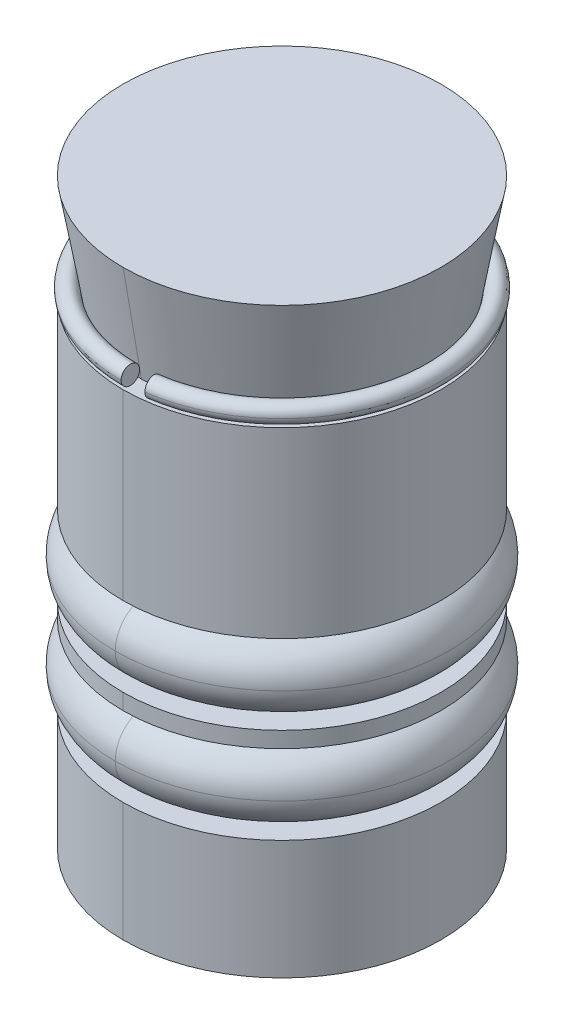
ISO-10303-21;
HEADER;
FILE_DESCRIPTION(('STEP AP214'),'2;1');
FILE_NAME('part.step','',(''),(''),'','','');
FILE_SCHEMA(('AUTOMOTIVE_DESIGN { 1 0 10303 214 1 1 1 1 }'));
ENDSEC;
DATA;
#1=APPLICATION_CONTEXT('core data for automotive mechanical design processes');
#2=APPLICATION_PROTOCOL_DEFINITION('international standard','automotive_design',2000,#1);
#3=PRODUCT_CONTEXT('',#1,'mechanical');
#4=PRODUCT('Part','Part','',(#3));
#5=PRODUCT_RELATED_PRODUCT_CATEGORY('part','',(#4));
#6=PRODUCT_DEFINITION_FORMATION('','',#4);
#7=PRODUCT_DEFINITION_CONTEXT('part definition',#1,'design');
#8=PRODUCT_DEFINITION('design','',#6,#7);
#9=PRODUCT_DEFINITION_SHAPE('','',#8);
#10=(LENGTH_UNIT() NAMED_UNIT(*) SI_UNIT(.MILLI.,.METRE.));
#11=(NAMED_UNIT(*) PLANE_ANGLE_UNIT() SI_UNIT($,.RADIAN.));
#12=(NAMED_UNIT(*) SI_UNIT($,.STERADIAN.) SOLID_ANGLE_UNIT());
#13=UNCERTAINTY_MEASURE_WITH_UNIT(LENGTH_MEASURE(1.E-05),#10,'distance_accuracy_value','');
#14=(GEOMETRIC_REPRESENTATION_CONTEXT(3) GLOBAL_UNCERTAINTY_ASSIGNED_CONTEXT((#13)) GLOBAL_UNIT_ASSIGNED_CONTEXT((#10,
#11,#12)) REPRESENTATION_CONTEXT('',''));
#15=CARTESIAN_POINT('',(0.,0.,0.));
#16=DIRECTION('',(0.,0.,1.));
#17=DIRECTION('',(1.,0.,0.));
#18=AXIS2_PLACEMENT_3D('',#15,#16,#17);
#19=CARTESIAN_POINT('',(0.396863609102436,9.175,2.83655403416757));
#20=DIRECTION('',(0.990353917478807,0.,-0.138560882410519));
#21=DIRECTION('',(0.,-1.,0.));
#22=AXIS2_PLACEMENT_3D('',#19,#20,#21);
#23=PLANE('',#22);
#24=CARTESIAN_POINT('',(0.396863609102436,9.175,2.83655403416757));
#25=DIRECTION('',(0.990353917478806,0.,-0.138560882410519));
#26=DIRECTION('',(-0.138560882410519,0.,-0.990353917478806));
#27=AXIS2_PLACEMENT_3D('',#24,#25,#26);
#28=CIRCLE('',#27,0.175);
#29=CARTESIAN_POINT('',(0.372615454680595,9.175,2.66324209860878));
#30=VERTEX_POINT('',#29);
#31=CARTESIAN_POINT('',(0.421111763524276,9.175,3.00986596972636));
#32=VERTEX_POINT('',#31);
#33=EDGE_CURVE('P0_E56',#30,#32,#28,.T.);
#34=ORIENTED_EDGE('',*,*,#33,.F.);
#35=CARTESIAN_POINT('',(0.396863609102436,9.175,2.83655403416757));
#36=DIRECTION('',(0.990353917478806,0.,-0.138560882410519));
#37=DIRECTION('',(-0.138560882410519,0.,-0.990353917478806));
#38=AXIS2_PLACEMENT_3D('',#35,#36,#37);
#39=CIRCLE('',#38,0.175);
#40=EDGE_CURVE('P0_E26',#32,#30,#39,.T.);
#41=ORIENTED_EDGE('',*,*,#40,.F.);
#42=EDGE_LOOP('',(#34,#41));
#43=FACE_BOUND('',#42,.T.);
#44=ADVANCED_FACE('P0_F16',(#43),#23,.F.);
#45=CARTESIAN_POINT('',(0.,9.175,2.86418217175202));
#46=DIRECTION('',(1.,0.,0.));
#47=DIRECTION('',(0.,1.,0.));
#48=AXIS2_PLACEMENT_3D('',#45,#46,#47);
#49=PLANE('',#48);
#50=CARTESIAN_POINT('',(0.,9.175,2.86418217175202));
#51=DIRECTION('',(1.,0.,0.));
#52=DIRECTION('',(0.,0.,-1.));
#53=AXIS2_PLACEMENT_3D('',#50,#51,#52);
#54=CIRCLE('',#53,0.175);
#55=CARTESIAN_POINT('',(0.,9.175,2.68918217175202));
#56=VERTEX_POINT('',#55);
#57=CARTESIAN_POINT('',(0.,9.175,3.03918217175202));
#58=VERTEX_POINT('',#57);
#59=EDGE_CURVE('P0_E19',#56,#58,#54,.T.);
#60=ORIENTED_EDGE('',*,*,#59,.T.);
#61=CARTESIAN_POINT('',(0.,9.175,2.86418217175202));
#62=DIRECTION('',(1.,0.,0.));
#63=DIRECTION('',(0.,0.,-1.));
#64=AXIS2_PLACEMENT_3D('',#61,#62,#63);
#65=CIRCLE('',#64,0.175);
#66=EDGE_CURVE('P0_E11',#58,#56,#65,.T.);
#67=ORIENTED_EDGE('',*,*,#66,.T.);
#68=EDGE_LOOP('',(#60,#67));
#69=FACE_BOUND('',#68,.T.);
#70=ADVANCED_FACE('P0_F79',(#69),#49,.T.);
#71=CARTESIAN_POINT('',(0.,9.175,0.));
#72=DIRECTION('',(0.,1.,0.));
#73=DIRECTION('',(0.,0.,1.));
#74=AXIS2_PLACEMENT_3D('',#71,#72,#73);
#75=TOROIDAL_SURFACE('',#74,2.86418217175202,0.175);
#76=CARTESIAN_POINT('',(0.,9.175,0.));
#77=DIRECTION('',(0.,1.,0.));
#78=DIRECTION('',(0.,0.,1.));
#79=AXIS2_PLACEMENT_3D('',#76,#77,#78);
#80=CIRCLE('',#79,3.03918217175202);
#81=EDGE_CURVE('P0_E61',#32,#58,#80,.T.);
#82=ORIENTED_EDGE('',*,*,#81,.F.);
#83=ORIENTED_EDGE('',*,*,#40,.T.);
#84=CARTESIAN_POINT('',(0.,9.175,0.));
#85=DIRECTION('',(0.,1.,0.));
#86=DIRECTION('',(0.,0.,1.));
#87=AXIS2_PLACEMENT_3D('',#84,#85,#86);
#88=CIRCLE('',#87,2.68918217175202);
#89=EDGE_CURVE('P0_E58',#30,#56,#88,.T.);
#90=ORIENTED_EDGE('',*,*,#89,.T.);
#91=ORIENTED_EDGE('',*,*,#66,.F.);
#92=EDGE_LOOP('',(#82,#83,#90,#91));
#93=FACE_BOUND('',#92,.T.);
#94=ADVANCED_FACE('P0_F62',(#93),#75,.T.);
#95=CARTESIAN_POINT('',(0.,9.175,0.));
#96=DIRECTION('',(0.,1.,0.));
#97=DIRECTION('',(0.,0.,1.));
#98=AXIS2_PLACEMENT_3D('',#95,#96,#97);
#99=TOROIDAL_SURFACE('',#98,2.86418217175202,0.175);
#100=ORIENTED_EDGE('',*,*,#33,.T.);
#101=ORIENTED_EDGE('',*,*,#81,.T.);
#102=ORIENTED_EDGE('',*,*,#59,.F.);
#103=ORIENTED_EDGE('',*,*,#89,.F.);
#104=EDGE_LOOP('',(#100,#101,#102,#103));
#105=FACE_BOUND('',#104,.T.);
#106=ADVANCED_FACE('P0_F67',(#105),#99,.T.);
#107=CLOSED_SHELL('',(#44,#70,#94,#106));
#108=MANIFOLD_SOLID_BREP('P0_B1',#107);
#109=CARTESIAN_POINT('',(0.,11.,0.));
#110=DIRECTION('',(0.,-1.,0.));
#111=DIRECTION('',(0.,0.,-1.));
#112=AXIS2_PLACEMENT_3D('',#109,#110,#111);
#113=PLANE('',#112);
#114=CARTESIAN_POINT('',(0.,11.,0.));
#115=DIRECTION('',(0.,1.,0.));
#116=DIRECTION('',(0.,0.,1.));
#117=AXIS2_PLACEMENT_3D('',#114,#115,#116);
#118=CIRCLE('',#117,3.);
#119=CARTESIAN_POINT('',(0.,11.,3.));
#120=VERTEX_POINT('',#119);
#121=CARTESIAN_POINT('',(0.,11.,-3.));
#122=VERTEX_POINT('',#121);
#123=EDGE_CURVE('P1_E173',#120,#122,#118,.T.);
#124=ORIENTED_EDGE('',*,*,#123,.T.);
#125=CARTESIAN_POINT('',(0.,11.,0.));
#126=DIRECTION('',(0.,1.,0.));
#127=DIRECTION('',(0.,0.,1.));
#128=AXIS2_PLACEMENT_3D('',#125,#126,#127);
#129=CIRCLE('',#128,3.);
#130=EDGE_CURVE('P1_E11',#122,#120,#129,.T.);
#131=ORIENTED_EDGE('',*,*,#130,.T.);
#132=EDGE_LOOP('',(#124,#131));
#133=FACE_BOUND('',#132,.T.);
#134=ADVANCED_FACE('P1_F16',(#133),#113,.F.);
#135=CARTESIAN_POINT('',(0.,9.,0.));
#136=DIRECTION('',(0.,1.,0.));
#137=DIRECTION('',(0.,0.,1.));
#138=AXIS2_PLACEMENT_3D('',#135,#136,#137);
#139=CONICAL_SURFACE('',#138,2.65371595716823,0.171442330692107);
#140=DIRECTION('',(0.,0.985339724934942,-0.170603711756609));
#141=VECTOR('',#140,1.);
#142=CARTESIAN_POINT('',(0.,9.,-2.65371595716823));
#143=LINE('',#142,#141);
#144=CARTESIAN_POINT('',(0.,9.,-2.65371595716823));
#145=VERTEX_POINT('',#144);
#146=EDGE_CURVE('P1_E162',#145,#122,#143,.T.);
#147=ORIENTED_EDGE('',*,*,#146,.F.);
#148=CARTESIAN_POINT('',(0.,9.,0.));
#149=DIRECTION('',(0.,1.,0.));
#150=DIRECTION('',(0.,0.,1.));
#151=AXIS2_PLACEMENT_3D('',#148,#149,#150);
#152=CIRCLE('',#151,2.65371595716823);
#153=CARTESIAN_POINT('',(0.,9.,2.65371595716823));
#154=VERTEX_POINT('',#153);
#155=EDGE_CURVE('P1_E27',#145,#154,#152,.T.);
#156=ORIENTED_EDGE('',*,*,#155,.T.);
#157=DIRECTION('',(0.,0.985339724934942,0.170603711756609));
#158=VECTOR('',#157,1.);
#159=CARTESIAN_POINT('',(0.,9.,2.65371595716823));
#160=LINE('',#159,#158);
#161=EDGE_CURVE('P1_E159',#154,#120,#160,.T.);
#162=ORIENTED_EDGE('',*,*,#161,.T.);
#163=ORIENTED_EDGE('',*,*,#130,.F.);
#164=EDGE_LOOP('',(#147,#156,#162,#163));
#165=FACE_BOUND('',#164,.T.);
#166=ADVANCED_FACE('P1_F18',(#165),#139,.T.);
#167=CARTESIAN_POINT('',(0.,9.,-3.));
#168=DIRECTION('',(0.,-1.,0.));
#169=DIRECTION('',(0.,0.,-1.));
#170=AXIS2_PLACEMENT_3D('',#167,#168,#169);
#171=PLANE('',#170);
#172=CARTESIAN_POINT('',(0.,9.,0.));
#173=DIRECTION('',(0.,1.,0.));
#174=DIRECTION('',(0.,0.,1.));
#175=AXIS2_PLACEMENT_3D('',#172,#173,#174);
#176=CIRCLE('',#175,2.65371595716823);
#177=EDGE_CURVE('P1_E171',#154,#145,#176,.T.);
#178=ORIENTED_EDGE('',*,*,#177,.F.);
#179=ORIENTED_EDGE('',*,*,#155,.F.);
#180=EDGE_LOOP('',(#178,#179));
#181=FACE_BOUND('',#180,.T.);
#182=CARTESIAN_POINT('',(0.,9.,0.));
#183=DIRECTION('',(0.,1.,0.));
#184=DIRECTION('',(0.,0.,1.));
#185=AXIS2_PLACEMENT_3D('',#182,#183,#184);
#186=CIRCLE('',#185,3.);
#187=CARTESIAN_POINT('',(0.,9.,3.));
#188=VERTEX_POINT('',#187);
#189=CARTESIAN_POINT('',(0.,9.,-3.));
#190=VERTEX_POINT('',#189);
#191=EDGE_CURVE('P1_E235',#188,#190,#186,.T.);
#192=ORIENTED_EDGE('',*,*,#191,.T.);
#193=CARTESIAN_POINT('',(0.,9.,0.));
#194=DIRECTION('',(0.,1.,0.));
#195=DIRECTION('',(0.,0.,1.));
#196=AXIS2_PLACEMENT_3D('',#193,#194,#195);
#197=CIRCLE('',#196,3.);
#198=EDGE_CURVE('P1_E167',#190,#188,#197,.T.);
#199=ORIENTED_EDGE('',*,*,#198,.T.);
#200=EDGE_LOOP('',(#192,#199));
#201=FACE_BOUND('',#200,.T.);
#202=ADVANCED_FACE('P1_F177',(#181,#201),#171,.F.);
#203=CARTESIAN_POINT('',(0.,11.,0.));
#204=DIRECTION('',(0.,1.,0.));
#205=DIRECTION('',(0.,0.,1.));
#206=AXIS2_PLACEMENT_3D('',#203,#204,#205);
#207=CYLINDRICAL_SURFACE('',#206,3.);
#208=DIRECTION('',(0.,1.,0.));
#209=VECTOR('',#208,1.);
#210=CARTESIAN_POINT('',(0.,11.,-3.));
#211=LINE('',#210,#209);
#212=CARTESIAN_POINT('',(0.,5.55,-3.));
#213=VERTEX_POINT('',#212);
#214=EDGE_CURVE('P1_E242',#213,#190,#211,.T.);
#215=ORIENTED_EDGE('',*,*,#214,.F.);
#216=CARTESIAN_POINT('',(0.,5.55,0.));
#217=DIRECTION('',(0.,1.,0.));
#218=DIRECTION('',(0.,0.,1.));
#219=AXIS2_PLACEMENT_3D('',#216,#217,#218);
#220=CIRCLE('',#219,3.);
#221=CARTESIAN_POINT('',(0.,5.55,3.));
#222=VERTEX_POINT('',#221);
#223=EDGE_CURVE('P1_E238',#213,#222,#220,.T.);
#224=ORIENTED_EDGE('',*,*,#223,.T.);
#225=DIRECTION('',(0.,1.,0.));
#226=VECTOR('',#225,1.);
#227=CARTESIAN_POINT('',(0.,11.,3.));
#228=LINE('',#227,#226);
#229=EDGE_CURVE('P1_E231',#222,#188,#228,.T.);
#230=ORIENTED_EDGE('',*,*,#229,.T.);
#231=ORIENTED_EDGE('',*,*,#198,.F.);
#232=EDGE_LOOP('',(#215,#224,#230,#231));
#233=FACE_BOUND('',#232,.T.);
#234=ADVANCED_FACE('P1_F449',(#233),#207,.T.);
#235=CARTESIAN_POINT('',(0.,5.55,-2.5));
#236=DIRECTION('',(0.,1.,0.));
#237=DIRECTION('',(0.,0.,-1.));
#238=AXIS2_PLACEMENT_3D('',#235,#236,#237);
#239=PLANE('',#238);
#240=CARTESIAN_POINT('',(0.,5.55,0.));
#241=DIRECTION('',(0.,1.,0.));
#242=DIRECTION('',(0.,0.,1.));
#243=AXIS2_PLACEMENT_3D('',#240,#241,#242);
#244=CIRCLE('',#243,2.5);
#245=CARTESIAN_POINT('',(0.,5.55,2.5));
#246=VERTEX_POINT('',#245);
#247=CARTESIAN_POINT('',(0.,5.55,-2.5));
#248=VERTEX_POINT('',#247);
#249=EDGE_CURVE('P1_E224',#246,#248,#244,.T.);
#250=ORIENTED_EDGE('',*,*,#249,.T.);
#251=CARTESIAN_POINT('',(0.,5.55,0.));
#252=DIRECTION('',(0.,1.,0.));
#253=DIRECTION('',(0.,0.,1.));
#254=AXIS2_PLACEMENT_3D('',#251,#252,#253);
#255=CIRCLE('',#254,2.5);
#256=EDGE_CURVE('P1_E180',#248,#246,#255,.T.);
#257=ORIENTED_EDGE('',*,*,#256,.T.);
#258=EDGE_LOOP('',(#250,#257));
#259=FACE_BOUND('',#258,.T.);
#260=CARTESIAN_POINT('',(0.,5.55,0.));
#261=DIRECTION('',(0.,1.,0.));
#262=DIRECTION('',(0.,0.,1.));
#263=AXIS2_PLACEMENT_3D('',#260,#261,#262);
#264=CIRCLE('',#263,3.);
#265=EDGE_CURVE('P1_E175',#222,#213,#264,.T.);
#266=ORIENTED_EDGE('',*,*,#265,.F.);
#267=ORIENTED_EDGE('',*,*,#223,.F.);
#268=EDGE_LOOP('',(#266,#267));
#269=FACE_BOUND('',#268,.T.);
#270=ADVANCED_FACE('P1_F348',(#259,#269),#239,.F.);
#271=CARTESIAN_POINT('',(0.,4.8,0.));
#272=DIRECTION('',(0.,1.,0.));
#273=DIRECTION('',(0.,0.,1.));
#274=AXIS2_PLACEMENT_3D('',#271,#272,#273);
#275=TOROIDAL_SURFACE('',#274,2.5,0.75);
#276=CARTESIAN_POINT('',(0.,4.8,0.));
#277=DIRECTION('',(0.,1.,0.));
#278=DIRECTION('',(0.,0.,1.));
#279=AXIS2_PLACEMENT_3D('',#276,#277,#278);
#280=CIRCLE('',#279,1.75);
#281=CARTESIAN_POINT('',(0.,4.8,1.75));
#282=VERTEX_POINT('',#281);
#283=CARTESIAN_POINT('',(0.,4.8,-1.75));
#284=VERTEX_POINT('',#283);
#285=EDGE_CURVE('P1_E218',#282,#284,#280,.T.);
#286=ORIENTED_EDGE('',*,*,#285,.F.);
#287=CARTESIAN_POINT('',(0.,4.8,2.5));
#288=DIRECTION('',(-1.,0.,0.));
#289=DIRECTION('',(0.,0.,1.));
#290=AXIS2_PLACEMENT_3D('',#287,#288,#289);
#291=CIRCLE('',#290,0.75);
#292=CARTESIAN_POINT('',(0.,4.05,2.5));
#293=VERTEX_POINT('',#292);
#294=EDGE_CURVE('P1_E204',#282,#293,#291,.T.);
#295=ORIENTED_EDGE('',*,*,#294,.T.);
#296=CARTESIAN_POINT('',(0.,4.05,0.));
#297=DIRECTION('',(0.,1.,0.));
#298=DIRECTION('',(0.,0.,1.));
#299=AXIS2_PLACEMENT_3D('',#296,#297,#298);
#300=CIRCLE('',#299,2.5);
#301=CARTESIAN_POINT('',(0.,4.05,-2.5));
#302=VERTEX_POINT('',#301);
#303=EDGE_CURVE('P1_E74',#293,#302,#300,.T.);
#304=ORIENTED_EDGE('',*,*,#303,.T.);
#305=CARTESIAN_POINT('',(0.,4.8,-2.5));
#306=DIRECTION('',(1.,0.,0.));
#307=DIRECTION('',(0.,0.,-1.));
#308=AXIS2_PLACEMENT_3D('',#305,#306,#307);
#309=CIRCLE('',#308,0.75);
#310=EDGE_CURVE('P1_E20',#284,#302,#309,.T.);
#311=ORIENTED_EDGE('',*,*,#310,.F.);
#312=EDGE_LOOP('',(#286,#295,#304,#311));
#313=FACE_BOUND('',#312,.T.);
#314=ADVANCED_FACE('P1_F359',(#313),#275,.F.);
#315=CARTESIAN_POINT('',(0.,4.05,-2.5));
#316=DIRECTION('',(0.,-1.,0.));
#317=DIRECTION('',(0.,0.,-1.));
#318=AXIS2_PLACEMENT_3D('',#315,#316,#317);
#319=PLANE('',#318);
#320=ORIENTED_EDGE('',*,*,#303,.F.);
#321=CARTESIAN_POINT('',(0.,4.05,0.));
#322=DIRECTION('',(0.,1.,0.));
#323=DIRECTION('',(0.,0.,1.));
#324=AXIS2_PLACEMENT_3D('',#321,#322,#323);
#325=CIRCLE('',#324,2.5);
#326=EDGE_CURVE('P1_E207',#302,#293,#325,.T.);
#327=ORIENTED_EDGE('',*,*,#326,.F.);
#328=EDGE_LOOP('',(#320,#327));
#329=FACE_BOUND('',#328,.T.);
#330=CARTESIAN_POINT('',(0.,4.05,0.));
#331=DIRECTION('',(0.,1.,0.));
#332=DIRECTION('',(0.,0.,1.));
#333=AXIS2_PLACEMENT_3D('',#330,#331,#332);
#334=CIRCLE('',#333,3.);
#335=CARTESIAN_POINT('',(0.,4.05,3.));
#336=VERTEX_POINT('',#335);
#337=CARTESIAN_POINT('',(0.,4.05,-3.));
#338=VERTEX_POINT('',#337);
#339=EDGE_CURVE('P1_E195',#336,#338,#334,.T.);
#340=ORIENTED_EDGE('',*,*,#339,.T.);
#341=CARTESIAN_POINT('',(0.,4.05,0.));
#342=DIRECTION('',(0.,1.,0.));
#343=DIRECTION('',(0.,0.,1.));
#344=AXIS2_PLACEMENT_3D('',#341,#342,#343);
#345=CIRCLE('',#344,3.);
#346=EDGE_CURVE('P1_E273',#338,#336,#345,.T.);
#347=ORIENTED_EDGE('',*,*,#346,.T.);
#348=EDGE_LOOP('',(#340,#347));
#349=FACE_BOUND('',#348,.T.);
#350=ADVANCED_FACE('P1_F435',(#329,#349),#319,.F.);
#351=CARTESIAN_POINT('',(0.,11.,0.));
#352=DIRECTION('',(0.,1.,0.));
#353=DIRECTION('',(0.,0.,1.));
#354=AXIS2_PLACEMENT_3D('',#351,#352,#353);
#355=CYLINDRICAL_SURFACE('',#354,3.);
#356=DIRECTION('',(0.,1.,0.));
#357=VECTOR('',#356,1.);
#358=CARTESIAN_POINT('',(0.,11.,-3.));
#359=LINE('',#358,#357);
#360=CARTESIAN_POINT('',(0.,3.75,-3.));
#361=VERTEX_POINT('',#360);
#362=EDGE_CURVE('P1_E199',#361,#338,#359,.T.);
#363=ORIENTED_EDGE('',*,*,#362,.F.);
#364=CARTESIAN_POINT('',(0.,3.75,0.));
#365=DIRECTION('',(0.,1.,0.));
#366=DIRECTION('',(0.,0.,1.));
#367=AXIS2_PLACEMENT_3D('',#364,#365,#366);
#368=CIRCLE('',#367,3.);
#369=CARTESIAN_POINT('',(0.,3.75,3.));
#370=VERTEX_POINT('',#369);
#371=EDGE_CURVE('P1_E228',#361,#370,#368,.T.);
#372=ORIENTED_EDGE('',*,*,#371,.T.);
#373=DIRECTION('',(0.,1.,0.));
#374=VECTOR('',#373,1.);
#375=CARTESIAN_POINT('',(0.,11.,3.));
#376=LINE('',#375,#374);
#377=EDGE_CURVE('P1_E198',#370,#336,#376,.T.);
#378=ORIENTED_EDGE('',*,*,#377,.T.);
#379=ORIENTED_EDGE('',*,*,#346,.F.);
#380=EDGE_LOOP('',(#363,#372,#378,#379));
#381=FACE_BOUND('',#380,.T.);
#382=ADVANCED_FACE('P1_F440',(#381),#355,.T.);
#383=CARTESIAN_POINT('',(0.,3.75,-2.5));
#384=DIRECTION('',(0.,1.,0.));
#385=DIRECTION('',(0.,0.,-1.));
#386=AXIS2_PLACEMENT_3D('',#383,#384,#385);
#387=PLANE('',#386);
#388=CARTESIAN_POINT('',(0.,3.75,0.));
#389=DIRECTION('',(0.,1.,0.));
#390=DIRECTION('',(0.,0.,1.));
#391=AXIS2_PLACEMENT_3D('',#388,#389,#390);
#392=CIRCLE('',#391,2.5);
#393=CARTESIAN_POINT('',(0.,3.75,2.5));
#394=VERTEX_POINT('',#393);
#395=CARTESIAN_POINT('',(0.,3.75,-2.5));
#396=VERTEX_POINT('',#395);
#397=EDGE_CURVE('P1_E315',#394,#396,#392,.T.);
#398=ORIENTED_EDGE('',*,*,#397,.T.);
#399=CARTESIAN_POINT('',(0.,3.75,0.));
#400=DIRECTION('',(0.,1.,0.));
#401=DIRECTION('',(0.,0.,1.));
#402=AXIS2_PLACEMENT_3D('',#399,#400,#401);
#403=CIRCLE('',#402,2.5);
#404=EDGE_CURVE('P1_E260',#396,#394,#403,.T.);
#405=ORIENTED_EDGE('',*,*,#404,.T.);
#406=EDGE_LOOP('',(#398,#405));
#407=FACE_BOUND('',#406,.T.);
#408=CARTESIAN_POINT('',(0.,3.75,0.));
#409=DIRECTION('',(0.,1.,0.));
#410=DIRECTION('',(0.,0.,1.));
#411=AXIS2_PLACEMENT_3D('',#408,#409,#410);
#412=CIRCLE('',#411,3.);
#413=EDGE_CURVE('P1_E200',#370,#361,#412,.T.);
#414=ORIENTED_EDGE('',*,*,#413,.F.);
#415=ORIENTED_EDGE('',*,*,#371,.F.);
#416=EDGE_LOOP('',(#414,#415));
#417=FACE_BOUND('',#416,.T.);
#418=ADVANCED_FACE('P1_F536',(#407,#417),#387,.F.);
#419=CARTESIAN_POINT('',(0.,3.,0.));
#420=DIRECTION('',(0.,1.,0.));
#421=DIRECTION('',(0.,0.,1.));
#422=AXIS2_PLACEMENT_3D('',#419,#420,#421);
#423=TOROIDAL_SURFACE('',#422,2.5,0.75);
#424=CARTESIAN_POINT('',(0.,3.,0.));
#425=DIRECTION('',(0.,1.,0.));
#426=DIRECTION('',(0.,0.,1.));
#427=AXIS2_PLACEMENT_3D('',#424,#425,#426);
#428=CIRCLE('',#427,1.75);
#429=CARTESIAN_POINT('',(0.,3.,1.75));
#430=VERTEX_POINT('',#429);
#431=CARTESIAN_POINT('',(0.,3.,-1.75));
#432=VERTEX_POINT('',#431);
#433=EDGE_CURVE('P1_E223',#430,#432,#428,.T.);
#434=ORIENTED_EDGE('',*,*,#433,.F.);
#435=CARTESIAN_POINT('',(0.,3.,2.5));
#436=DIRECTION('',(-1.,0.,0.));
#437=DIRECTION('',(0.,0.,1.));
#438=AXIS2_PLACEMENT_3D('',#435,#436,#437);
#439=CIRCLE('',#438,0.75);
#440=CARTESIAN_POINT('',(0.,2.25,2.5));
#441=VERTEX_POINT('',#440);
#442=EDGE_CURVE('P1_E295',#430,#441,#439,.T.);
#443=ORIENTED_EDGE('',*,*,#442,.T.);
#444=CARTESIAN_POINT('',(0.,2.25,0.));
#445=DIRECTION('',(0.,1.,0.));
#446=DIRECTION('',(0.,0.,1.));
#447=AXIS2_PLACEMENT_3D('',#444,#445,#446);
#448=CIRCLE('',#447,2.5);
#449=CARTESIAN_POINT('',(0.,2.25,-2.5));
#450=VERTEX_POINT('',#449);
#451=EDGE_CURVE('P1_E225',#441,#450,#448,.T.);
#452=ORIENTED_EDGE('',*,*,#451,.T.);
#453=CARTESIAN_POINT('',(0.,3.,-2.5));
#454=DIRECTION('',(1.,0.,0.));
#455=DIRECTION('',(0.,0.,-1.));
#456=AXIS2_PLACEMENT_3D('',#453,#454,#455);
#457=CIRCLE('',#456,0.75);
#458=EDGE_CURVE('P1_E193',#432,#450,#457,.T.);
#459=ORIENTED_EDGE('',*,*,#458,.F.);
#460=EDGE_LOOP('',(#434,#443,#452,#459));
#461=FACE_BOUND('',#460,.T.);
#462=ADVANCED_FACE('P1_F531',(#461),#423,.F.);
#463=CARTESIAN_POINT('',(0.,2.25,-2.5));
#464=DIRECTION('',(0.,-1.,0.));
#465=DIRECTION('',(0.,0.,-1.));
#466=AXIS2_PLACEMENT_3D('',#463,#464,#465);
#467=PLANE('',#466);
#468=ORIENTED_EDGE('',*,*,#451,.F.);
#469=CARTESIAN_POINT('',(0.,2.25,0.));
#470=DIRECTION('',(0.,1.,0.));
#471=DIRECTION('',(0.,0.,1.));
#472=AXIS2_PLACEMENT_3D('',#469,#470,#471);
#473=CIRCLE('',#472,2.5);
#474=EDGE_CURVE('P1_E305',#450,#441,#473,.T.);
#475=ORIENTED_EDGE('',*,*,#474,.F.);
#476=EDGE_LOOP('',(#468,#475));
#477=FACE_BOUND('',#476,.T.);
#478=CARTESIAN_POINT('',(0.,2.25,0.));
#479=DIRECTION('',(0.,1.,0.));
#480=DIRECTION('',(0.,0.,1.));
#481=AXIS2_PLACEMENT_3D('',#478,#479,#480);
#482=CIRCLE('',#481,3.);
#483=CARTESIAN_POINT('',(0.,2.25,3.));
#484=VERTEX_POINT('',#483);
#485=CARTESIAN_POINT('',(0.,2.25,-3.));
#486=VERTEX_POINT('',#485);
#487=EDGE_CURVE('P1_E270',#484,#486,#482,.T.);
#488=ORIENTED_EDGE('',*,*,#487,.T.);
#489=CARTESIAN_POINT('',(0.,2.25,0.));
#490=DIRECTION('',(0.,1.,0.));
#491=DIRECTION('',(0.,0.,1.));
#492=AXIS2_PLACEMENT_3D('',#489,#490,#491);
#493=CIRCLE('',#492,3.);
#494=EDGE_CURVE('P1_E41',#486,#484,#493,.T.);
#495=ORIENTED_EDGE('',*,*,#494,.T.);
#496=EDGE_LOOP('',(#488,#495));
#497=FACE_BOUND('',#496,.T.);
#498=ADVANCED_FACE('P1_F410',(#477,#497),#467,.F.);
#499=CARTESIAN_POINT('',(0.,11.,0.));
#500=DIRECTION('',(0.,1.,0.));
#501=DIRECTION('',(0.,0.,1.));
#502=AXIS2_PLACEMENT_3D('',#499,#500,#501);
#503=CYLINDRICAL_SURFACE('',#502,3.);
#504=DIRECTION('',(0.,1.,0.));
#505=VECTOR('',#504,1.);
#506=CARTESIAN_POINT('',(0.,11.,-3.));
#507=LINE('',#506,#505);
#508=CARTESIAN_POINT('',(0.,0.,-3.));
#509=VERTEX_POINT('',#508);
#510=EDGE_CURVE('P1_E286',#509,#486,#507,.T.);
#511=ORIENTED_EDGE('',*,*,#510,.F.);
#512=CARTESIAN_POINT('',(0.,0.,0.));
#513=DIRECTION('',(0.,1.,0.));
#514=DIRECTION('',(0.,0.,1.));
#515=AXIS2_PLACEMENT_3D('',#512,#513,#514);
#516=CIRCLE('',#515,3.);
#517=CARTESIAN_POINT('',(0.,0.,3.));
#518=VERTEX_POINT('',#517);
#519=EDGE_CURVE('P1_E241',#509,#518,#516,.T.);
#520=ORIENTED_EDGE('',*,*,#519,.T.);
#521=DIRECTION('',(0.,1.,0.));
#522=VECTOR('',#521,1.);
#523=CARTESIAN_POINT('',(0.,11.,3.));
#524=LINE('',#523,#522);
#525=EDGE_CURVE('P1_E267',#518,#484,#524,.T.);
#526=ORIENTED_EDGE('',*,*,#525,.T.);
#527=ORIENTED_EDGE('',*,*,#494,.F.);
#528=EDGE_LOOP('',(#511,#520,#526,#527));
#529=FACE_BOUND('',#528,.T.);
#530=ADVANCED_FACE('P1_F283',(#529),#503,.T.);
#531=CARTESIAN_POINT('',(0.,0.,-3.));
#532=DIRECTION('',(0.,1.,0.));
#533=DIRECTION('',(0.,0.,-1.));
#534=AXIS2_PLACEMENT_3D('',#531,#532,#533);
#535=PLANE('',#534);
#536=CARTESIAN_POINT('',(0.,0.,0.));
#537=DIRECTION('',(0.,1.,0.));
#538=DIRECTION('',(0.,0.,1.));
#539=AXIS2_PLACEMENT_3D('',#536,#537,#538);
#540=CIRCLE('',#539,3.);
#541=EDGE_CURVE('P1_E292',#518,#509,#540,.T.);
#542=ORIENTED_EDGE('',*,*,#541,.F.);
#543=ORIENTED_EDGE('',*,*,#519,.F.);
#544=EDGE_LOOP('',(#542,#543));
#545=FACE_BOUND('',#544,.T.);
#546=ADVANCED_FACE('P1_F293',(#545),#535,.F.);
#547=CARTESIAN_POINT('',(0.,11.,0.));
#548=DIRECTION('',(0.,1.,0.));
#549=DIRECTION('',(0.,0.,1.));
#550=AXIS2_PLACEMENT_3D('',#547,#548,#549);
#551=CYLINDRICAL_SURFACE('',#550,3.);
#552=ORIENTED_EDGE('',*,*,#541,.T.);
#553=ORIENTED_EDGE('',*,*,#510,.T.);
#554=ORIENTED_EDGE('',*,*,#487,.F.);
#555=ORIENTED_EDGE('',*,*,#525,.F.);
#556=EDGE_LOOP('',(#552,#553,#554,#555));
#557=FACE_BOUND('',#556,.T.);
#558=ADVANCED_FACE('P1_F291',(#557),#551,.T.);
#559=CARTESIAN_POINT('',(0.,3.,0.));
#560=DIRECTION('',(0.,1.,0.));
#561=DIRECTION('',(0.,0.,1.));
#562=AXIS2_PLACEMENT_3D('',#559,#560,#561);
#563=TOROIDAL_SURFACE('',#562,2.5,0.75);
#564=CARTESIAN_POINT('',(0.,3.,0.));
#565=DIRECTION('',(0.,1.,0.));
#566=DIRECTION('',(0.,0.,1.));
#567=AXIS2_PLACEMENT_3D('',#564,#565,#566);
#568=CIRCLE('',#567,1.75);
#569=EDGE_CURVE('P1_E262',#432,#430,#568,.T.);
#570=ORIENTED_EDGE('',*,*,#569,.F.);
#571=ORIENTED_EDGE('',*,*,#458,.T.);
#572=ORIENTED_EDGE('',*,*,#474,.T.);
#573=ORIENTED_EDGE('',*,*,#442,.F.);
#574=EDGE_LOOP('',(#570,#571,#572,#573));
#575=FACE_BOUND('',#574,.T.);
#576=ADVANCED_FACE('P1_F425',(#575),#563,.F.);
#577=CARTESIAN_POINT('',(0.,11.,0.));
#578=DIRECTION('',(0.,1.,0.));
#579=DIRECTION('',(0.,0.,1.));
#580=AXIS2_PLACEMENT_3D('',#577,#578,#579);
#581=CYLINDRICAL_SURFACE('',#580,3.);
#582=ORIENTED_EDGE('',*,*,#413,.T.);
#583=ORIENTED_EDGE('',*,*,#362,.T.);
#584=ORIENTED_EDGE('',*,*,#339,.F.);
#585=ORIENTED_EDGE('',*,*,#377,.F.);
#586=EDGE_LOOP('',(#582,#583,#584,#585));
#587=FACE_BOUND('',#586,.T.);
#588=ADVANCED_FACE('P1_F419',(#587),#581,.T.);
#589=CARTESIAN_POINT('',(0.,4.8,0.));
#590=DIRECTION('',(0.,1.,0.));
#591=DIRECTION('',(0.,0.,1.));
#592=AXIS2_PLACEMENT_3D('',#589,#590,#591);
#593=TOROIDAL_SURFACE('',#592,2.5,0.75);
#594=CARTESIAN_POINT('',(0.,4.8,0.));
#595=DIRECTION('',(0.,1.,0.));
#596=DIRECTION('',(0.,0.,1.));
#597=AXIS2_PLACEMENT_3D('',#594,#595,#596);
#598=CIRCLE('',#597,1.75);
#599=EDGE_CURVE('P1_E189',#284,#282,#598,.T.);
#600=ORIENTED_EDGE('',*,*,#599,.F.);
#601=ORIENTED_EDGE('',*,*,#310,.T.);
#602=ORIENTED_EDGE('',*,*,#326,.T.);
#603=ORIENTED_EDGE('',*,*,#294,.F.);
#604=EDGE_LOOP('',(#600,#601,#602,#603));
#605=FACE_BOUND('',#604,.T.);
#606=ADVANCED_FACE('P1_F424',(#605),#593,.F.);
#607=CARTESIAN_POINT('',(0.,11.,0.));
#608=DIRECTION('',(0.,1.,0.));
#609=DIRECTION('',(0.,0.,1.));
#610=AXIS2_PLACEMENT_3D('',#607,#608,#609);
#611=CYLINDRICAL_SURFACE('',#610,3.);
#612=ORIENTED_EDGE('',*,*,#265,.T.);
#613=ORIENTED_EDGE('',*,*,#214,.T.);
#614=ORIENTED_EDGE('',*,*,#191,.F.);
#615=ORIENTED_EDGE('',*,*,#229,.F.);
#616=EDGE_LOOP('',(#612,#613,#614,#615));
#617=FACE_BOUND('',#616,.T.);
#618=ADVANCED_FACE('P1_F372',(#617),#611,.T.);
#619=CARTESIAN_POINT('',(0.,9.,0.));
#620=DIRECTION('',(0.,1.,0.));
#621=DIRECTION('',(0.,0.,1.));
#622=AXIS2_PLACEMENT_3D('',#619,#620,#621);
#623=CONICAL_SURFACE('',#622,2.65371595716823,0.171442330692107);
#624=ORIENTED_EDGE('',*,*,#177,.T.);
#625=ORIENTED_EDGE('',*,*,#146,.T.);
#626=ORIENTED_EDGE('',*,*,#123,.F.);
#627=ORIENTED_EDGE('',*,*,#161,.F.);
#628=EDGE_LOOP('',(#624,#625,#626,#627));
#629=FACE_BOUND('',#628,.T.);
#630=ADVANCED_FACE('P1_F170',(#629),#623,.T.);
#631=CARTESIAN_POINT('',(0.,4.8,0.));
#632=DIRECTION('',(0.,1.,0.));
#633=DIRECTION('',(0.,0.,1.));
#634=AXIS2_PLACEMENT_3D('',#631,#632,#633);
#635=TOROIDAL_SURFACE('',#634,2.5,0.75);
#636=CARTESIAN_POINT('',(0.,4.8,-2.5));
#637=DIRECTION('',(1.,0.,0.));
#638=DIRECTION('',(0.,0.,-1.));
#639=AXIS2_PLACEMENT_3D('',#636,#637,#638);
#640=CIRCLE('',#639,0.75);
#641=EDGE_CURVE('P1_E253',#248,#284,#640,.T.);
#642=ORIENTED_EDGE('',*,*,#641,.T.);
#643=ORIENTED_EDGE('',*,*,#599,.T.);
#644=CARTESIAN_POINT('',(0.,4.8,2.5));
#645=DIRECTION('',(-1.,0.,0.));
#646=DIRECTION('',(0.,0.,1.));
#647=AXIS2_PLACEMENT_3D('',#644,#645,#646);
#648=CIRCLE('',#647,0.75);
#649=EDGE_CURVE('P1_E214',#246,#282,#648,.T.);
#650=ORIENTED_EDGE('',*,*,#649,.F.);
#651=ORIENTED_EDGE('',*,*,#256,.F.);
#652=EDGE_LOOP('',(#642,#643,#650,#651));
#653=FACE_BOUND('',#652,.T.);
#654=ADVANCED_FACE('P1_F355',(#653),#635,.F.);
#655=CARTESIAN_POINT('',(0.,3.,0.));
#656=DIRECTION('',(0.,1.,0.));
#657=DIRECTION('',(0.,0.,1.));
#658=AXIS2_PLACEMENT_3D('',#655,#656,#657);
#659=TOROIDAL_SURFACE('',#658,2.5,0.75);
#660=CARTESIAN_POINT('',(0.,3.,-2.5));
#661=DIRECTION('',(1.,0.,0.));
#662=DIRECTION('',(0.,0.,-1.));
#663=AXIS2_PLACEMENT_3D('',#660,#661,#662);
#664=CIRCLE('',#663,0.75);
#665=EDGE_CURVE('P1_E252',#396,#432,#664,.T.);
#666=ORIENTED_EDGE('',*,*,#665,.T.);
#667=ORIENTED_EDGE('',*,*,#569,.T.);
#668=CARTESIAN_POINT('',(0.,3.,2.5));
#669=DIRECTION('',(-1.,0.,0.));
#670=DIRECTION('',(0.,0.,1.));
#671=AXIS2_PLACEMENT_3D('',#668,#669,#670);
#672=CIRCLE('',#671,0.75);
#673=EDGE_CURVE('P1_E219',#394,#430,#672,.T.);
#674=ORIENTED_EDGE('',*,*,#673,.F.);
#675=ORIENTED_EDGE('',*,*,#404,.F.);
#676=EDGE_LOOP('',(#666,#667,#674,#675));
#677=FACE_BOUND('',#676,.T.);
#678=ADVANCED_FACE('P1_F387',(#677),#659,.F.);
#679=CARTESIAN_POINT('',(0.,3.,0.));
#680=DIRECTION('',(0.,1.,0.));
#681=DIRECTION('',(0.,0.,1.));
#682=AXIS2_PLACEMENT_3D('',#679,#680,#681);
#683=TOROIDAL_SURFACE('',#682,2.5,0.75);
#684=ORIENTED_EDGE('',*,*,#673,.T.);
#685=ORIENTED_EDGE('',*,*,#433,.T.);
#686=ORIENTED_EDGE('',*,*,#665,.F.);
#687=ORIENTED_EDGE('',*,*,#397,.F.);
#688=EDGE_LOOP('',(#684,#685,#686,#687));
#689=FACE_BOUND('',#688,.T.);
#690=ADVANCED_FACE('P1_F382',(#689),#683,.F.);
#691=CARTESIAN_POINT('',(0.,4.8,0.));
#692=DIRECTION('',(0.,1.,0.));
#693=DIRECTION('',(0.,0.,1.));
#694=AXIS2_PLACEMENT_3D('',#691,#692,#693);
#695=TOROIDAL_SURFACE('',#694,2.5,0.75);
#696=ORIENTED_EDGE('',*,*,#649,.T.);
#697=ORIENTED_EDGE('',*,*,#285,.T.);
#698=ORIENTED_EDGE('',*,*,#641,.F.);
#699=ORIENTED_EDGE('',*,*,#249,.F.);
#700=EDGE_LOOP('',(#696,#697,#698,#699));
#701=FACE_BOUND('',#700,.T.);
#702=ADVANCED_FACE('P1_F352',(#701),#695,.F.);
#703=CLOSED_SHELL('',(#134,#166,#202,#234,#270,#314,#350,#382,#418,#462,#498,#530,#546,#558,
#576,#588,#606,#618,#630,#654,#678,#690,#702));
#704=MANIFOLD_SOLID_BREP('P1_B1',#703);
#705=CARTESIAN_POINT('',(0.,4.8,0.));
#706=DIRECTION('',(0.,1.,0.));
#707=DIRECTION('',(0.,0.,1.));
#708=AXIS2_PLACEMENT_3D('',#705,#706,#707);
#709=TOROIDAL_SURFACE('',#708,2.5,0.65);
#710=CARTESIAN_POINT('',(0.,4.8,0.));
#711=DIRECTION('',(0.,1.,0.));
#712=DIRECTION('',(0.,0.,1.));
#713=AXIS2_PLACEMENT_3D('',#710,#711,#712);
#714=CIRCLE('',#713,3.15);
#715=CARTESIAN_POINT('',(0.,4.8,-3.15));
#716=VERTEX_POINT('',#715);
#717=CARTESIAN_POINT('',(0.,4.8,3.15));
#718=VERTEX_POINT('',#717);
#719=EDGE_CURVE('P2_E20',#716,#718,#714,.T.);
#720=ORIENTED_EDGE('',*,*,#719,.F.);
#721=CARTESIAN_POINT('',(0.,4.8,-2.5));
#722=DIRECTION('',(1.,0.,0.));
#723=DIRECTION('',(0.,0.,-1.));
#724=AXIS2_PLACEMENT_3D('',#721,#722,#723);
#725=CIRCLE('',#724,0.65);
#726=CARTESIAN_POINT('',(0.,4.8,-1.85));
#727=VERTEX_POINT('',#726);
#728=EDGE_CURVE('P2_E11',#727,#716,#725,.T.);
#729=ORIENTED_EDGE('',*,*,#728,.F.);
#730=CARTESIAN_POINT('',(0.,4.8,0.));
#731=DIRECTION('',(0.,1.,0.));
#732=DIRECTION('',(0.,0.,1.));
#733=AXIS2_PLACEMENT_3D('',#730,#731,#732);
#734=CIRCLE('',#733,1.85);
#735=CARTESIAN_POINT('',(0.,4.8,1.85));
#736=VERTEX_POINT('',#735);
#737=EDGE_CURVE('P2_E57',#727,#736,#734,.T.);
#738=ORIENTED_EDGE('',*,*,#737,.T.);
#739=CARTESIAN_POINT('',(0.,4.8,2.5));
#740=DIRECTION('',(-1.,0.,0.));
#741=DIRECTION('',(0.,0.,1.));
#742=AXIS2_PLACEMENT_3D('',#739,#740,#741);
#743=CIRCLE('',#742,0.65);
#744=EDGE_CURVE('P2_E27',#736,#718,#743,.T.);
#745=ORIENTED_EDGE('',*,*,#744,.T.);
#746=EDGE_LOOP('',(#720,#729,#738,#745));
#747=FACE_BOUND('',#746,.T.);
#748=ADVANCED_FACE('P2_F16',(#747),#709,.T.);
#749=CARTESIAN_POINT('',(0.,4.8,0.));
#750=DIRECTION('',(0.,1.,0.));
#751=DIRECTION('',(0.,0.,1.));
#752=AXIS2_PLACEMENT_3D('',#749,#750,#751);
#753=TOROIDAL_SURFACE('',#752,2.5,0.65);
#754=CARTESIAN_POINT('',(0.,4.8,0.));
#755=DIRECTION('',(0.,1.,0.));
#756=DIRECTION('',(0.,0.,1.));
#757=AXIS2_PLACEMENT_3D('',#754,#755,#756);
#758=CIRCLE('',#757,3.15);
#759=EDGE_CURVE('P2_E67',#718,#716,#758,.T.);
#760=ORIENTED_EDGE('',*,*,#759,.F.);
#761=ORIENTED_EDGE('',*,*,#744,.F.);
#762=CARTESIAN_POINT('',(0.,4.8,0.));
#763=DIRECTION('',(0.,1.,0.));
#764=DIRECTION('',(0.,0.,1.));
#765=AXIS2_PLACEMENT_3D('',#762,#763,#764);
#766=CIRCLE('',#765,1.85);
#767=EDGE_CURVE('P2_E61',#736,#727,#766,.T.);
#768=ORIENTED_EDGE('',*,*,#767,.T.);
#769=ORIENTED_EDGE('',*,*,#728,.T.);
#770=EDGE_LOOP('',(#760,#761,#768,#769));
#771=FACE_BOUND('',#770,.T.);
#772=ADVANCED_FACE('P2_F62',(#771),#753,.T.);
#773=CARTESIAN_POINT('',(0.,4.8,0.));
#774=DIRECTION('',(0.,1.,0.));
#775=DIRECTION('',(0.,0.,1.));
#776=AXIS2_PLACEMENT_3D('',#773,#774,#775);
#777=TOROIDAL_SURFACE('',#776,2.5,0.65);
#778=CARTESIAN_POINT('',(0.,4.8,2.5));
#779=DIRECTION('',(-1.,0.,0.));
#780=DIRECTION('',(0.,0.,1.));
#781=AXIS2_PLACEMENT_3D('',#778,#779,#780);
#782=CIRCLE('',#781,0.65);
#783=EDGE_CURVE('P2_E71',#718,#736,#782,.T.);
#784=ORIENTED_EDGE('',*,*,#783,.F.);
#785=ORIENTED_EDGE('',*,*,#759,.T.);
#786=CARTESIAN_POINT('',(0.,4.8,-2.5));
#787=DIRECTION('',(1.,0.,0.));
#788=DIRECTION('',(0.,0.,-1.));
#789=AXIS2_PLACEMENT_3D('',#786,#787,#788);
#790=CIRCLE('',#789,0.65);
#791=EDGE_CURVE('P2_E70',#716,#727,#790,.T.);
#792=ORIENTED_EDGE('',*,*,#791,.T.);
#793=ORIENTED_EDGE('',*,*,#767,.F.);
#794=EDGE_LOOP('',(#784,#785,#792,#793));
#795=FACE_BOUND('',#794,.T.);
#796=ADVANCED_FACE('P2_F18',(#795),#777,.T.);
#797=CARTESIAN_POINT('',(0.,4.8,0.));
#798=DIRECTION('',(0.,1.,0.));
#799=DIRECTION('',(0.,0.,1.));
#800=AXIS2_PLACEMENT_3D('',#797,#798,#799);
#801=TOROIDAL_SURFACE('',#800,2.5,0.65);
#802=ORIENTED_EDGE('',*,*,#791,.F.);
#803=ORIENTED_EDGE('',*,*,#719,.T.);
#804=ORIENTED_EDGE('',*,*,#783,.T.);
#805=ORIENTED_EDGE('',*,*,#737,.F.);
#806=EDGE_LOOP('',(#802,#803,#804,#805));
#807=FACE_BOUND('',#806,.T.);
#808=ADVANCED_FACE('P2_F69',(#807),#801,.T.);
#809=CLOSED_SHELL('',(#748,#772,#796,#808));
#810=MANIFOLD_SOLID_BREP('P2_B1',#809);
#811=CARTESIAN_POINT('',(0.,3.,0.));
#812=DIRECTION('',(0.,1.,0.));
#813=DIRECTION('',(0.,0.,1.));
#814=AXIS2_PLACEMENT_3D('',#811,#812,#813);
#815=TOROIDAL_SURFACE('',#814,2.5,0.65);
#816=CARTESIAN_POINT('',(0.,3.,0.));
#817=DIRECTION('',(0.,1.,0.));
#818=DIRECTION('',(0.,0.,1.));
#819=AXIS2_PLACEMENT_3D('',#816,#817,#818);
#820=CIRCLE('',#819,3.15);
#821=CARTESIAN_POINT('',(0.,3.,-3.15));
#822=VERTEX_POINT('',#821);
#823=CARTESIAN_POINT('',(0.,3.,3.15));
#824=VERTEX_POINT('',#823);
#825=EDGE_CURVE('P3_E69',#822,#824,#820,.T.);
#826=ORIENTED_EDGE('',*,*,#825,.F.);
#827=CARTESIAN_POINT('',(0.,3.,-2.5));
#828=DIRECTION('',(1.,0.,0.));
#829=DIRECTION('',(0.,0.,-1.));
#830=AXIS2_PLACEMENT_3D('',#827,#828,#829);
#831=CIRCLE('',#830,0.65);
#832=CARTESIAN_POINT('',(0.,3.,-1.85));
#833=VERTEX_POINT('',#832);
#834=EDGE_CURVE('P3_E10',#833,#822,#831,.T.);
#835=ORIENTED_EDGE('',*,*,#834,.F.);
#836=CARTESIAN_POINT('',(0.,3.,0.));
#837=DIRECTION('',(0.,1.,0.));
#838=DIRECTION('',(0.,0.,1.));
#839=AXIS2_PLACEMENT_3D('',#836,#837,#838);
#840=CIRCLE('',#839,1.85);
#841=CARTESIAN_POINT('',(0.,3.,1.85));
#842=VERTEX_POINT('',#841);
#843=EDGE_CURVE('P3_E19',#833,#842,#840,.T.);
#844=ORIENTED_EDGE('',*,*,#843,.T.);
#845=CARTESIAN_POINT('',(0.,3.,2.5));
#846=DIRECTION('',(-1.,0.,0.));
#847=DIRECTION('',(0.,0.,1.));
#848=AXIS2_PLACEMENT_3D('',#845,#846,#847);
#849=CIRCLE('',#848,0.65);
#850=EDGE_CURVE('P3_E25',#842,#824,#849,.T.);
#851=ORIENTED_EDGE('',*,*,#850,.T.);
#852=EDGE_LOOP('',(#826,#835,#844,#851));
#853=FACE_BOUND('',#852,.T.);
#854=ADVANCED_FACE('P3_F15',(#853),#815,.T.);
#855=CARTESIAN_POINT('',(0.,3.,0.));
#856=DIRECTION('',(0.,1.,0.));
#857=DIRECTION('',(0.,0.,1.));
#858=AXIS2_PLACEMENT_3D('',#855,#856,#857);
#859=TOROIDAL_SURFACE('',#858,2.5,0.65);
#860=CARTESIAN_POINT('',(0.,3.,0.));
#861=DIRECTION('',(0.,1.,0.));
#862=DIRECTION('',(0.,0.,1.));
#863=AXIS2_PLACEMENT_3D('',#860,#861,#862);
#864=CIRCLE('',#863,3.15);
#865=EDGE_CURVE('P3_E56',#824,#822,#864,.T.);
#866=ORIENTED_EDGE('',*,*,#865,.F.);
#867=ORIENTED_EDGE('',*,*,#850,.F.);
#868=CARTESIAN_POINT('',(0.,3.,0.));
#869=DIRECTION('',(0.,1.,0.));
#870=DIRECTION('',(0.,0.,1.));
#871=AXIS2_PLACEMENT_3D('',#868,#869,#870);
#872=CIRCLE('',#871,1.85);
#873=EDGE_CURVE('P3_E58',#842,#833,#872,.T.);
#874=ORIENTED_EDGE('',*,*,#873,.T.);
#875=ORIENTED_EDGE('',*,*,#834,.T.);
#876=EDGE_LOOP('',(#866,#867,#874,#875));
#877=FACE_BOUND('',#876,.T.);
#878=ADVANCED_FACE('P3_F55',(#877),#859,.T.);
#879=CARTESIAN_POINT('',(0.,3.,0.));
#880=DIRECTION('',(0.,1.,0.));
#881=DIRECTION('',(0.,0.,1.));
#882=AXIS2_PLACEMENT_3D('',#879,#880,#881);
#883=TOROIDAL_SURFACE('',#882,2.5,0.65);
#884=CARTESIAN_POINT('',(0.,3.,2.5));
#885=DIRECTION('',(-1.,0.,0.));
#886=DIRECTION('',(0.,0.,1.));
#887=AXIS2_PLACEMENT_3D('',#884,#885,#886);
#888=CIRCLE('',#887,0.65);
#889=EDGE_CURVE('P3_E66',#824,#842,#888,.T.);
#890=ORIENTED_EDGE('',*,*,#889,.F.);
#891=ORIENTED_EDGE('',*,*,#865,.T.);
#892=CARTESIAN_POINT('',(0.,3.,-2.5));
#893=DIRECTION('',(1.,0.,0.));
#894=DIRECTION('',(0.,0.,-1.));
#895=AXIS2_PLACEMENT_3D('',#892,#893,#894);
#896=CIRCLE('',#895,0.65);
#897=EDGE_CURVE('P3_E64',#822,#833,#896,.T.);
#898=ORIENTED_EDGE('',*,*,#897,.T.);
#899=ORIENTED_EDGE('',*,*,#873,.F.);
#900=EDGE_LOOP('',(#890,#891,#898,#899));
#901=FACE_BOUND('',#900,.T.);
#902=ADVANCED_FACE('P3_F62',(#901),#883,.T.);
#903=CARTESIAN_POINT('',(0.,3.,0.));
#904=DIRECTION('',(0.,1.,0.));
#905=DIRECTION('',(0.,0.,1.));
#906=AXIS2_PLACEMENT_3D('',#903,#904,#905);
#907=TOROIDAL_SURFACE('',#906,2.5,0.65);
#908=ORIENTED_EDGE('',*,*,#897,.F.);
#909=ORIENTED_EDGE('',*,*,#825,.T.);
#910=ORIENTED_EDGE('',*,*,#889,.T.);
#911=ORIENTED_EDGE('',*,*,#843,.F.);
#912=EDGE_LOOP('',(#908,#909,#910,#911));
#913=FACE_BOUND('',#912,.T.);
#914=ADVANCED_FACE('P3_F17',(#913),#907,.T.);
#915=CLOSED_SHELL('',(#854,#878,#902,#914));
#916=MANIFOLD_SOLID_BREP('P3_B1',#915);
#917=ADVANCED_BREP_SHAPE_REPRESENTATION('',(#18,#108,#704,#810,#916),#14);
#918=SHAPE_DEFINITION_REPRESENTATION(#9,#917);
ENDSEC;
END-ISO-10303-21;
